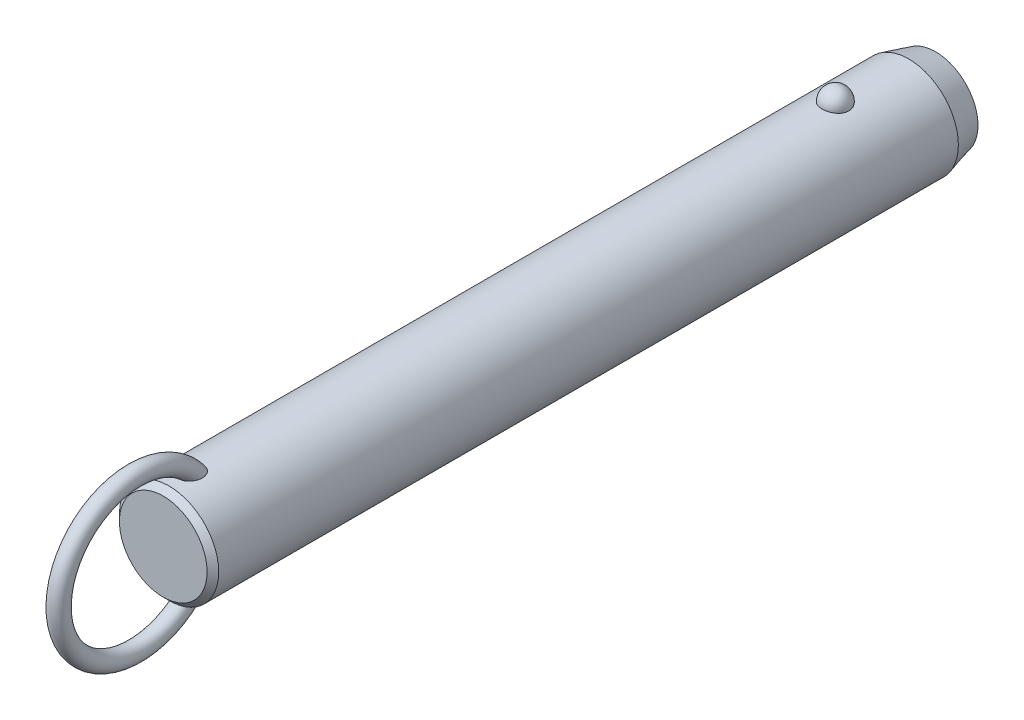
ISO-10303-21;
HEADER;
FILE_DESCRIPTION(('STEP AP214'),'2;1');
FILE_NAME('part.step','',(''),(''),'','','');
FILE_SCHEMA(('AUTOMOTIVE_DESIGN { 1 0 10303 214 1 1 1 1 }'));
ENDSEC;
DATA;
#1=APPLICATION_CONTEXT('core data for automotive mechanical design processes');
#2=APPLICATION_PROTOCOL_DEFINITION('international standard','automotive_design',2000,#1);
#3=PRODUCT_CONTEXT('',#1,'mechanical');
#4=PRODUCT('Part','Part','',(#3));
#5=PRODUCT_RELATED_PRODUCT_CATEGORY('part','',(#4));
#6=PRODUCT_DEFINITION_FORMATION('','',#4);
#7=PRODUCT_DEFINITION_CONTEXT('part definition',#1,'design');
#8=PRODUCT_DEFINITION('design','',#6,#7);
#9=PRODUCT_DEFINITION_SHAPE('','',#8);
#10=(LENGTH_UNIT() NAMED_UNIT(*) SI_UNIT(.MILLI.,.METRE.));
#11=(NAMED_UNIT(*) PLANE_ANGLE_UNIT() SI_UNIT($,.RADIAN.));
#12=(NAMED_UNIT(*) SI_UNIT($,.STERADIAN.) SOLID_ANGLE_UNIT());
#13=UNCERTAINTY_MEASURE_WITH_UNIT(LENGTH_MEASURE(1.E-05),#10,'distance_accuracy_value','');
#14=(GEOMETRIC_REPRESENTATION_CONTEXT(3) GLOBAL_UNCERTAINTY_ASSIGNED_CONTEXT((#13)) GLOBAL_UNIT_ASSIGNED_CONTEXT((#10,
#11,#12)) REPRESENTATION_CONTEXT('',''));
#15=CARTESIAN_POINT('',(0.,0.,0.));
#16=DIRECTION('',(0.,0.,1.));
#17=DIRECTION('',(1.,0.,0.));
#18=AXIS2_PLACEMENT_3D('',#15,#16,#17);
#19=CARTESIAN_POINT('',(0.,0.,134.6));
#20=DIRECTION('',(0.,0.,-1.));
#21=DIRECTION('',(-1.,0.,0.));
#22=AXIS2_PLACEMENT_3D('',#19,#20,#21);
#23=CYLINDRICAL_SURFACE('',#22,11.1);
#24=CARTESIAN_POINT('',(2.9724815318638,10.6945945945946,-3.));
#25=CARTESIAN_POINT('',(2.97247830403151,10.6945972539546,-2.83225059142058));
#26=CARTESIAN_POINT('',(2.95876598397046,10.6984356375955,-2.66445972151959));
#27=CARTESIAN_POINT('',(2.90424529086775,10.7133624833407,-2.33362381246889));
#28=CARTESIAN_POINT('',(2.8634252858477,10.7244540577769,-2.1705808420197));
#29=CARTESIAN_POINT('',(2.75573657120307,10.7526272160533,-1.85396767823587));
#30=CARTESIAN_POINT('',(2.68887937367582,10.7697061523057,-1.70039333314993));
#31=CARTESIAN_POINT('',(2.53079696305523,10.8079438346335,-1.40691598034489));
#32=CARTESIAN_POINT('',(2.43957264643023,10.8291024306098,-1.2670124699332));
#33=CARTESIAN_POINT('',(2.23458150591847,10.8732541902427,-1.00409565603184));
#34=CARTESIAN_POINT('',(2.12071295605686,10.8962553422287,-0.881162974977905));
#35=CARTESIAN_POINT('',(1.87365402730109,10.9414421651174,-0.656352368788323));
#36=CARTESIAN_POINT('',(1.74046358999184,10.9636278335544,-0.554474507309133));
#37=CARTESIAN_POINT('',(1.45872188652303,11.0046495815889,-0.374872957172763));
#38=CARTESIAN_POINT('',(1.31021276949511,11.0234944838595,-0.297085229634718));
#39=CARTESIAN_POINT('',(1.00170030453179,11.0557957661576,-0.167529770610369));
#40=CARTESIAN_POINT('',(0.841698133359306,11.0692526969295,-0.115759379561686));
#41=CARTESIAN_POINT('',(0.517607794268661,11.0890932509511,-0.0403925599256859));
#42=CARTESIAN_POINT('',(0.353633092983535,11.0955916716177,-0.0163383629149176));
#43=CARTESIAN_POINT('',(0.0238420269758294,11.1011989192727,0.0044517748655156));
#44=CARTESIAN_POINT('',(-0.141974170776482,11.1003084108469,0.00119017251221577));
#45=CARTESIAN_POINT('',(-0.468405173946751,11.0912990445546,-0.0323233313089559));
#46=CARTESIAN_POINT('',(-0.629059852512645,11.0832767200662,-0.0622147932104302));
#47=CARTESIAN_POINT('',(-0.942937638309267,11.0609962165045,-0.147645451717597));
#48=CARTESIAN_POINT('',(-1.09616062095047,11.0467379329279,-0.203185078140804));
#49=CARTESIAN_POINT('',(-1.39181061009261,11.0134071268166,-0.3387529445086));
#50=CARTESIAN_POINT('',(-1.53417383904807,10.9943086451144,-0.418913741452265));
#51=CARTESIAN_POINT('',(-1.80342160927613,10.9533667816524,-0.60144882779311));
#52=CARTESIAN_POINT('',(-1.9303046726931,10.9315231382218,-0.703825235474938));
#53=CARTESIAN_POINT('',(-2.16747598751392,10.887005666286,-0.930091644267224));
#54=CARTESIAN_POINT('',(-2.27742774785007,10.8643239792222,-1.05433291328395));
#55=CARTESIAN_POINT('',(-2.47517316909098,10.8209886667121,-1.31966633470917));
#56=CARTESIAN_POINT('',(-2.56296538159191,10.8003351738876,-1.46075958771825));
#57=CARTESIAN_POINT('',(-2.71500300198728,10.7631304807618,-1.75753646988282));
#58=CARTESIAN_POINT('',(-2.77898901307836,10.7466250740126,-1.91335887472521));
#59=CARTESIAN_POINT('',(-2.88046189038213,10.7198747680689,-2.2339152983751));
#60=CARTESIAN_POINT('',(-2.91794947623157,10.709629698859,-2.39864907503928));
#61=CARTESIAN_POINT('',(-2.96537819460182,10.6965949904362,-2.73165170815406));
#62=CARTESIAN_POINT('',(-2.97542891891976,10.693775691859,-2.89990378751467));
#63=CARTESIAN_POINT('',(-2.96804271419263,10.6958279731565,-3.235752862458));
#64=CARTESIAN_POINT('',(-2.95060646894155,10.7006993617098,-3.40334987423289));
#65=CARTESIAN_POINT('',(-2.88883358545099,10.71753912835,-3.73233906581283));
#66=CARTESIAN_POINT('',(-2.84462026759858,10.7294749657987,-3.89375610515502));
#67=CARTESIAN_POINT('',(-2.73050447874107,10.7590797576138,-4.20667949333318));
#68=CARTESIAN_POINT('',(-2.66060103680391,10.7767489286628,-4.35818546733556));
#69=CARTESIAN_POINT('',(-2.49642559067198,10.8159599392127,-4.6478542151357));
#70=CARTESIAN_POINT('',(-2.40203047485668,10.8375211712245,-4.78594458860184));
#71=CARTESIAN_POINT('',(-2.19143488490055,10.8820570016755,-5.0441038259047));
#72=CARTESIAN_POINT('',(-2.07523364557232,10.9050316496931,-5.16417205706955));
#73=CARTESIAN_POINT('',(-1.82361254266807,10.9499219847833,-5.38334833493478));
#74=CARTESIAN_POINT('',(-1.68812945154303,10.9718338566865,-5.48238464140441));
#75=CARTESIAN_POINT('',(-1.40191298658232,11.0120611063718,-5.65618873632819));
#76=CARTESIAN_POINT('',(-1.25118062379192,11.0303767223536,-5.73095813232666));
#77=CARTESIAN_POINT('',(-0.940570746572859,11.0611653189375,-5.85334725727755));
#78=CARTESIAN_POINT('',(-0.780821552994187,11.0737044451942,-5.90127578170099));
#79=CARTESIAN_POINT('',(-0.455204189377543,11.0918598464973,-5.96992976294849));
#80=CARTESIAN_POINT('',(-0.289336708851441,11.0974768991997,-5.99065827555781));
#81=CARTESIAN_POINT('',(0.0406846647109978,11.1011307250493,-6.00418773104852));
#82=CARTESIAN_POINT('',(0.204817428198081,11.099299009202,-5.99747318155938));
#83=CARTESIAN_POINT('',(0.5295530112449,11.088551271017,-5.9574031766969));
#84=CARTESIAN_POINT('',(0.69015594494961,11.0796354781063,-5.92404858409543));
#85=CARTESIAN_POINT('',(1.0027760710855,11.0557204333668,-5.83180084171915));
#86=CARTESIAN_POINT('',(1.15482001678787,11.0407414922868,-5.77299291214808));
#87=CARTESIAN_POINT('',(1.44678373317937,11.0062913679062,-5.63147366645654));
#88=CARTESIAN_POINT('',(1.58670279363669,10.9868199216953,-5.54876095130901));
#89=CARTESIAN_POINT('',(1.8527023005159,10.9451315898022,-5.36027644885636));
#90=CARTESIAN_POINT('',(1.97855158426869,10.9228788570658,-5.25418644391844));
#91=CARTESIAN_POINT('',(2.21080872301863,10.8782509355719,-5.02251354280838));
#92=CARTESIAN_POINT('',(2.31721312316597,10.8558757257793,-4.89692718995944));
#93=CARTESIAN_POINT('',(2.5094551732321,10.8130715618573,-4.62745408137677));
#94=CARTESIAN_POINT('',(2.59493284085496,10.7926798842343,-4.48330448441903));
#95=CARTESIAN_POINT('',(2.740862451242,10.7565495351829,-4.18236358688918));
#96=CARTESIAN_POINT('',(2.80132490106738,10.7408089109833,-4.02557762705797));
#97=CARTESIAN_POINT('',(2.88959070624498,10.7173718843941,-3.72475308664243));
#98=CARTESIAN_POINT('',(2.92062102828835,10.7088950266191,-3.58171216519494));
#99=CARTESIAN_POINT('',(2.96206765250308,10.6975052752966,-3.29245795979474));
#100=CARTESIAN_POINT('',(2.97248434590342,10.6945922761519,-3.14624473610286));
#101=CARTESIAN_POINT('',(2.9724815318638,10.6945945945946,-3.));
#102=B_SPLINE_CURVE_WITH_KNOTS('',3,(#24,#25,#26,#27,#28,#29,#30,#31,#32,#33,#34,#35,#36,#37,
#38,#39,#40,#41,#42,#43,#44,#45,#46,#47,#48,#49,#50,#51,#52,#53,#54,#55,#56,#57,#58,#59,#60,#61,
#62,#63,#64,#65,#66,#67,#68,#69,#70,#71,#72,#73,#74,#75,#76,#77,#78,#79,#80,#81,#82,#83,#84,#85,
#86,#87,#88,#89,#90,#91,#92,#93,#94,#95,#96,#97,#98,#99,#100,#101),.UNSPECIFIED.,.T.,.F.,(4,2,2,
2,2,2,2,2,2,2,2,2,2,2,2,2,2,2,2,2,2,2,2,2,2,2,2,2,2,2,2,2,2,2,2,2,2,2,4),(0.,0.502722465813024,
1.00566079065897,1.5083769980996,2.01107471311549,2.51608392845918,3.02109467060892,
3.52475118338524,4.02835620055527,4.523518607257,5.0186364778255,5.50715297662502,
5.9956776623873,6.48688002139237,6.97812923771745,7.47814366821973,7.9781907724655,
8.48353712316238,8.9888697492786,9.49218093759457,9.99547960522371,10.4964777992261,
10.997494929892,11.5010810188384,12.0046847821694,12.5099796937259,13.0152411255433,
13.5145635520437,14.0138298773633,14.5043200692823,14.9947943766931,15.4836390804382,
15.9725123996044,16.4685040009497,16.9645836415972,17.4686765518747,17.972557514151,
18.410841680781,18.849117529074),.UNSPECIFIED.);
#103=CARTESIAN_POINT('',(2.9724815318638,10.6945945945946,-3.));
#104=VERTEX_POINT('',#103);
#105=EDGE_CURVE('E41',#104,#104,#102,.T.);
#106=ORIENTED_EDGE('',*,*,#105,.T.);
#107=EDGE_LOOP('',(#106));
#108=FACE_BOUND('',#107,.T.);
#109=CARTESIAN_POINT('',(0.,0.,146.));
#110=DIRECTION('',(0.,0.,1.));
#111=DIRECTION('',(1.,0.,0.));
#112=AXIS2_PLACEMENT_3D('',#109,#110,#111);
#113=CIRCLE('',#112,11.1);
#114=CARTESIAN_POINT('',(11.1,0.,146.));
#115=VERTEX_POINT('',#114);
#116=EDGE_CURVE('E10',#115,#115,#113,.F.);
#117=ORIENTED_EDGE('',*,*,#116,.T.);
#118=EDGE_LOOP('',(#117));
#119=FACE_BOUND('',#118,.T.);
#120=CARTESIAN_POINT('',(-0.564520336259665,-11.0856356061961,138.257815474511));
#121=CARTESIAN_POINT('',(-0.667202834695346,-11.0804062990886,138.291283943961));
#122=CARTESIAN_POINT('',(-0.766875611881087,-11.0738877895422,138.333835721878));
#123=CARTESIAN_POINT('',(-0.95728412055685,-11.0590576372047,138.435419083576));
#124=CARTESIAN_POINT('',(-1.04801616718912,-11.0507452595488,138.49445742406));
#125=CARTESIAN_POINT('',(-1.21800952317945,-11.0333016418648,138.626529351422));
#126=CARTESIAN_POINT('',(-1.2973080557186,-11.0241732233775,138.699515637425));
#127=CARTESIAN_POINT('',(-1.44337665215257,-11.0060026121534,138.857037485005));
#128=CARTESIAN_POINT('',(-1.51014622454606,-10.9969604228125,138.941573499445));
#129=CARTESIAN_POINT('',(-1.63454620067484,-10.9791841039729,139.125521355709));
#130=CARTESIAN_POINT('',(-1.69127003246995,-10.9705107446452,139.225549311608));
#131=CARTESIAN_POINT('',(-1.7898078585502,-10.9548648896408,139.432790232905));
#132=CARTESIAN_POINT('',(-1.83161214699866,-10.9478935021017,139.540007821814));
#133=CARTESIAN_POINT('',(-1.91557028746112,-10.9335803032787,139.805408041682));
#134=CARTESIAN_POINT('',(-1.95040620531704,-10.9273269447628,139.965980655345));
#135=CARTESIAN_POINT('',(-1.99388326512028,-10.9194709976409,140.290697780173));
#136=CARTESIAN_POINT('',(-2.00248051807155,-10.9178762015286,140.454847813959));
#137=CARTESIAN_POINT('',(-1.99551615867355,-10.9191578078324,140.824650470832));
#138=CARTESIAN_POINT('',(-1.9732206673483,-10.9232807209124,141.030191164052));
#139=CARTESIAN_POINT('',(-1.9152976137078,-10.9335244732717,141.333595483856));
#140=CARTESIAN_POINT('',(-1.89184575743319,-10.9376266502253,141.434088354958));
#141=CARTESIAN_POINT('',(-1.83700674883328,-10.9469720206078,141.632855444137));
#142=CARTESIAN_POINT('',(-1.80562070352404,-10.9522150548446,141.731129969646));
#143=CARTESIAN_POINT('',(-1.73463055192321,-10.9636837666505,141.925914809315));
#144=CARTESIAN_POINT('',(-1.69493416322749,-10.9699202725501,142.022390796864));
#145=CARTESIAN_POINT('',(-1.60745141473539,-10.9830806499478,142.211626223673));
#146=CARTESIAN_POINT('',(-1.55966150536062,-10.9900048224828,142.304384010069));
#147=CARTESIAN_POINT('',(-1.45591812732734,-11.0042280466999,142.484690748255));
#148=CARTESIAN_POINT('',(-1.40000013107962,-11.0115253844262,142.572260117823));
#149=CARTESIAN_POINT('',(-1.27937470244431,-11.0261911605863,142.741029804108));
#150=CARTESIAN_POINT('',(-1.21467835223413,-11.0335594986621,142.82223795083));
#151=CARTESIAN_POINT('',(-1.08218150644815,-11.0473027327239,142.969001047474));
#152=CARTESIAN_POINT('',(-1.01522633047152,-11.0537063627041,143.035309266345));
#153=CARTESIAN_POINT('',(-0.872952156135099,-11.065850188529,143.158378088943));
#154=CARTESIAN_POINT('',(-0.797642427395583,-11.0715911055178,143.215149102));
#155=CARTESIAN_POINT('',(-0.651396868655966,-11.081071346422,143.307515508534));
#156=CARTESIAN_POINT('',(-0.581712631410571,-11.0849841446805,143.345049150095));
#157=CARTESIAN_POINT('',(-0.437066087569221,-11.0916271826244,143.408259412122));
#158=CARTESIAN_POINT('',(-0.362109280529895,-11.0943586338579,143.433948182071));
#159=CARTESIAN_POINT('',(-0.207828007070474,-11.0983242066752,143.471117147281));
#160=CARTESIAN_POINT('',(-0.12846771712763,-11.0995432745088,143.482454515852));
#161=CARTESIAN_POINT('',(0.0309101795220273,-11.1002423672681,143.488965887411));
#162=CARTESIAN_POINT('',(0.110927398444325,-11.0997233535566,143.484148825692));
#163=CARTESIAN_POINT('',(0.25640659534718,-11.097240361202,143.460959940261));
#164=CARTESIAN_POINT('',(0.322235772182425,-11.0955074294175,143.444754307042));
#165=CARTESIAN_POINT('',(0.450635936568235,-11.0910350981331,143.402600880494));
#166=CARTESIAN_POINT('',(0.513205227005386,-11.0882951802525,143.376648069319));
#167=CARTESIAN_POINT('',(0.662626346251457,-11.0805620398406,143.302607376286));
#168=CARTESIAN_POINT('',(0.747127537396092,-11.0751144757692,143.249845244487));
#169=CARTESIAN_POINT('',(0.906756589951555,-11.0631932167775,143.131720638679));
#170=CARTESIAN_POINT('',(0.981859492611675,-11.0567168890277,143.066325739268));
#171=CARTESIAN_POINT('',(1.10712207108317,-11.0447856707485,142.94226337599));
#172=CARTESIAN_POINT('',(1.15909566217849,-11.0394280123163,142.885383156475));
#173=CARTESIAN_POINT('',(1.2579192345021,-11.0286040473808,142.767327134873));
#174=CARTESIAN_POINT('',(1.30476642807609,-11.0231376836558,142.706149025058));
#175=CARTESIAN_POINT('',(1.43818612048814,-11.0068027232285,142.517305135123));
#176=CARTESIAN_POINT('',(1.51751767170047,-10.9960104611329,142.384453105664));
#177=CARTESIAN_POINT('',(1.63597546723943,-10.9788847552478,142.153137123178));
#178=CARTESIAN_POINT('',(1.67988876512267,-10.9722190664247,142.057053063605));
#179=CARTESIAN_POINT('',(1.75953241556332,-10.9597298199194,141.861431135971));
#180=CARTESIAN_POINT('',(1.7952596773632,-10.9539065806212,141.761891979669));
#181=CARTESIAN_POINT('',(1.85844731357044,-10.9433632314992,141.56021118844));
#182=CARTESIAN_POINT('',(1.88591073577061,-10.9386427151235,141.45807052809));
#183=CARTESIAN_POINT('',(1.93234324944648,-10.9305350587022,141.251819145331));
#184=CARTESIAN_POINT('',(1.95131065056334,-10.9271481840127,141.147708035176));
#185=CARTESIAN_POINT('',(1.9904020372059,-10.9201183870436,140.865458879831));
#186=CARTESIAN_POINT('',(2.00221217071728,-10.9179256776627,140.686037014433));
#187=CARTESIAN_POINT('',(1.99711676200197,-10.9188636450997,140.327713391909));
#188=CARTESIAN_POINT('',(1.98026150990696,-10.9219849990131,140.148811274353));
#189=CARTESIAN_POINT('',(1.92151657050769,-10.9324473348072,139.83645144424));
#190=CARTESIAN_POINT('',(1.88605081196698,-10.9386915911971,139.701759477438));
#191=CARTESIAN_POINT('',(1.79393020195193,-10.9541780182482,139.439966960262));
#192=CARTESIAN_POINT('',(1.73729868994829,-10.9634168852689,139.312858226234));
#193=CARTESIAN_POINT('',(1.61237037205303,-10.9824218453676,139.089418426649));
#194=CARTESIAN_POINT('',(1.54715374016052,-10.9918945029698,138.991345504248));
#195=CARTESIAN_POINT('',(1.40127026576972,-11.0114415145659,138.807434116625));
#196=CARTESIAN_POINT('',(1.32060742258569,-11.0215157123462,138.721592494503));
#197=CARTESIAN_POINT('',(1.1447478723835,-11.041168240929,138.565163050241));
#198=CARTESIAN_POINT('',(1.04947805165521,-11.0507437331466,138.494656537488));
#199=CARTESIAN_POINT('',(0.847278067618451,-11.0680789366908,138.372640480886));
#200=CARTESIAN_POINT('',(0.74035174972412,-11.0758392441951,138.321124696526));
#201=CARTESIAN_POINT('',(0.529289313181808,-11.0878275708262,138.243485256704));
#202=CARTESIAN_POINT('',(0.425895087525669,-11.0923259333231,138.215377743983));
#203=CARTESIAN_POINT('',(0.215723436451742,-11.0984001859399,138.177703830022));
#204=CARTESIAN_POINT('',(0.108947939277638,-11.0999777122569,138.168127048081));
#205=CARTESIAN_POINT('',(-0.0938962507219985,-11.1000196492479,138.167877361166));
#206=CARTESIAN_POINT('',(-0.189967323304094,-11.0987797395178,138.175408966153));
#207=CARTESIAN_POINT('',(-0.379657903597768,-11.0939111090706,138.205507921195));
#208=CARTESIAN_POINT('',(-0.47327735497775,-11.0902823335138,138.228075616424));
#209=CARTESIAN_POINT('',(-0.564520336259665,-11.0856356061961,138.257815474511));
#210=B_SPLINE_CURVE_WITH_KNOTS('',3,(#120,#121,#122,#123,#124,#125,#126,#127,#128,#129,#130,
#131,#132,#133,#134,#135,#136,#137,#138,#139,#140,#141,#142,#143,#144,#145,#146,#147,#148,#149,
#150,#151,#152,#153,#154,#155,#156,#157,#158,#159,#160,#161,#162,#163,#164,#165,#166,#167,#168,
#169,#170,#171,#172,#173,#174,#175,#176,#177,#178,#179,#180,#181,#182,#183,#184,#185,#186,#187,
#188,#189,#190,#191,#192,#193,#194,#195,#196,#197,#198,#199,#200,#201,#202,#203,#204,#205,#206,
#207,#208,#209),.UNSPECIFIED.,.T.,.F.,(4,2,2,2,2,2,2,2,2,2,2,2,2,2,2,2,2,2,2,2,2,2,2,2,2,2,2,2,
2,2,2,2,2,2,2,2,2,2,2,2,2,2,2,2,4),(0.,0.323999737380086,0.64813245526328,0.971184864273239,
1.29424994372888,1.63886237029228,1.98369857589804,2.47426059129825,2.96564271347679,
3.58257396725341,3.89215258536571,4.20168803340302,4.51486273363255,4.82817514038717,
5.14015911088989,5.45175282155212,5.73442856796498,6.01679375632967,6.2536458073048,
6.49025437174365,6.72919963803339,6.96801276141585,7.17061258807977,7.37331685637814,
7.67094989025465,7.96935728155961,8.20075067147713,8.43226927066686,8.89581623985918,
9.21306533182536,9.53043400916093,9.84768549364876,10.1650000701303,10.7022930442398,
11.2386443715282,11.655339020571,12.071575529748,12.4245637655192,12.7774607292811,
13.1321855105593,13.4867936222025,13.8068771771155,14.1267813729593,14.4146787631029,
14.7025827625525),.UNSPECIFIED.);
#211=CARTESIAN_POINT('',(-0.564520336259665,-11.0856356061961,138.257815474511));
#212=VERTEX_POINT('',#211);
#213=EDGE_CURVE('E60',#212,#212,#210,.T.);
#214=ORIENTED_EDGE('',*,*,#213,.T.);
#215=EDGE_LOOP('',(#214));
#216=FACE_BOUND('',#215,.T.);
#217=CARTESIAN_POINT('',(-0.564520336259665,11.0856356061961,138.257815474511));
#218=CARTESIAN_POINT('',(-0.468542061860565,11.0905203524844,138.226545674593));
#219=CARTESIAN_POINT('',(-0.369793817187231,11.0942886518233,138.203157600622));
#220=CARTESIAN_POINT('',(-0.169555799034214,11.0991586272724,138.173085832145));
#221=CARTESIAN_POINT('',(-0.0680604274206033,11.1002543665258,138.16643932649));
#222=CARTESIAN_POINT('',(0.134549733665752,11.099646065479,138.170157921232));
#223=CARTESIAN_POINT('',(0.235664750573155,11.0979441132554,138.18051033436));
#224=CARTESIAN_POINT('',(0.434632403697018,11.0919342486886,138.217831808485));
#225=CARTESIAN_POINT('',(0.532486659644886,11.0876276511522,138.244792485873));
#226=CARTESIAN_POINT('',(0.722445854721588,11.0768742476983,138.3144096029));
#227=CARTESIAN_POINT('',(0.814543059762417,11.0704246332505,138.357086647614));
#228=CARTESIAN_POINT('',(0.990565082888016,11.0560659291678,138.456648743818));
#229=CARTESIAN_POINT('',(1.07448844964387,11.048156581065,138.513536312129));
#230=CARTESIAN_POINT('',(1.23562672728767,11.0313221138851,138.642210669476));
#231=CARTESIAN_POINT('',(1.3124268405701,11.0223686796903,138.714511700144));
#232=CARTESIAN_POINT('',(1.45398030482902,11.0045918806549,138.870042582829));
#233=CARTESIAN_POINT('',(1.51873073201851,10.9957685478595,138.953275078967));
#234=CARTESIAN_POINT('',(1.64107232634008,10.9782087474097,139.136384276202));
#235=CARTESIAN_POINT('',(1.6974317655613,10.9695572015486,139.237089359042));
#236=CARTESIAN_POINT('',(1.79515063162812,10.9539887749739,139.445626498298));
#237=CARTESIAN_POINT('',(1.83649966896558,10.9470730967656,139.55346343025));
#238=CARTESIAN_POINT('',(1.91931148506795,10.9329211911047,139.820399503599));
#239=CARTESIAN_POINT('',(1.95340104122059,10.9267904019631,139.981861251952));
#240=CARTESIAN_POINT('',(1.99526195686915,10.9192174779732,140.30821631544));
#241=CARTESIAN_POINT('',(2.00298989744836,10.9177830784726,140.47311484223));
#242=CARTESIAN_POINT('',(1.99396251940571,10.9194420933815,140.844100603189));
#243=CARTESIAN_POINT('',(1.97050829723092,10.923774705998,141.05003871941));
#244=CARTESIAN_POINT('',(1.91079643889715,10.9343131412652,141.353901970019));
#245=CARTESIAN_POINT('',(1.88673702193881,10.9385106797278,141.454529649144));
#246=CARTESIAN_POINT('',(1.8306550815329,10.9480376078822,141.653510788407));
#247=CARTESIAN_POINT('',(1.79863369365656,10.9533668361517,141.751864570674));
#248=CARTESIAN_POINT('',(1.72633365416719,10.9649954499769,141.946720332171));
#249=CARTESIAN_POINT('',(1.68596409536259,10.9713053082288,142.04318790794));
#250=CARTESIAN_POINT('',(1.59707998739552,10.9845964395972,142.232323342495));
#251=CARTESIAN_POINT('',(1.54856169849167,10.9915780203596,142.324989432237));
#252=CARTESIAN_POINT('',(1.44330168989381,11.0058935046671,142.504975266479));
#253=CARTESIAN_POINT('',(1.3865974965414,11.0132257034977,142.592316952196));
#254=CARTESIAN_POINT('',(1.26431158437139,11.0279330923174,142.760456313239));
#255=CARTESIAN_POINT('',(1.19874160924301,11.0353082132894,142.841262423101));
#256=CARTESIAN_POINT('',(1.06542088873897,11.048931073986,142.985985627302));
#257=CARTESIAN_POINT('',(0.998640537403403,11.0552153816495,143.050784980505));
#258=CARTESIAN_POINT('',(0.856896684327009,11.0671032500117,143.170846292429));
#259=CARTESIAN_POINT('',(0.781942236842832,11.0727075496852,143.226118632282));
#260=CARTESIAN_POINT('',(0.636276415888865,11.081949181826,143.315972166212));
#261=CARTESIAN_POINT('',(0.566755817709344,11.0857572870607,143.352441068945));
#262=CARTESIAN_POINT('',(0.422602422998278,11.0921860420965,143.413533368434));
#263=CARTESIAN_POINT('',(0.347974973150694,11.0948079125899,143.438168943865));
#264=CARTESIAN_POINT('',(0.194593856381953,11.0985608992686,143.473323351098));
#265=CARTESIAN_POINT('',(0.115807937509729,11.0996777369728,143.483706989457));
#266=CARTESIAN_POINT('',(-0.0422499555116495,11.1002003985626,143.488574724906));
#267=CARTESIAN_POINT('',(-0.121521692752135,11.09960699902,143.483066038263));
#268=CARTESIAN_POINT('',(-0.266046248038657,11.0970123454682,143.458827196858));
#269=CARTESIAN_POINT('',(-0.331661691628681,11.0952283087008,143.442135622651));
#270=CARTESIAN_POINT('',(-0.459588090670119,11.0906663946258,143.399111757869));
#271=CARTESIAN_POINT('',(-0.52189737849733,11.0878880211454,143.372774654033));
#272=CARTESIAN_POINT('',(-0.671446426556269,11.0800342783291,143.297513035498));
#273=CARTESIAN_POINT('',(-0.756250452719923,11.0744969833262,143.243818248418));
#274=CARTESIAN_POINT('',(-0.916349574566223,11.0624045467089,143.123802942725));
#275=CARTESIAN_POINT('',(-0.991618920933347,11.0558467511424,143.057449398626));
#276=CARTESIAN_POINT('',(-1.11713140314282,11.0437783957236,142.931633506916));
#277=CARTESIAN_POINT('',(-1.1692053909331,11.0383619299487,142.873952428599));
#278=CARTESIAN_POINT('',(-1.26817476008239,11.02743010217,142.754280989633));
#279=CARTESIAN_POINT('',(-1.31506731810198,11.0219146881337,142.692288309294));
#280=CARTESIAN_POINT('',(-1.40399813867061,11.0109399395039,142.564784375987));
#281=CARTESIAN_POINT('',(-1.44602864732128,11.0054807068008,142.499267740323));
#282=CARTESIAN_POINT('',(-1.52538779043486,10.9947621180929,142.365422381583));
#283=CARTESIAN_POINT('',(-1.56271516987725,10.9895028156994,142.297092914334));
#284=CARTESIAN_POINT('',(-1.64537943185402,10.9774790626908,142.133210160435));
#285=CARTESIAN_POINT('',(-1.68879497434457,10.9708503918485,142.0366735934));
#286=CARTESIAN_POINT('',(-1.76740738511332,10.9584602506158,141.840236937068));
#287=CARTESIAN_POINT('',(-1.80260120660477,10.95269910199,141.74033561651));
#288=CARTESIAN_POINT('',(-1.86468657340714,10.9423003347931,141.537966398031));
#289=CARTESIAN_POINT('',(-1.8915816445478,10.9376622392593,141.435499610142));
#290=CARTESIAN_POINT('',(-1.93682458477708,10.9297405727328,141.228642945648));
#291=CARTESIAN_POINT('',(-1.95517082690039,10.9264572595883,141.124252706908));
#292=CARTESIAN_POINT('',(-1.99232562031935,10.9197647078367,140.84262876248));
#293=CARTESIAN_POINT('',(-2.00294603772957,10.9177914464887,140.664185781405));
#294=CARTESIAN_POINT('',(-1.99566675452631,10.9191290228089,140.307996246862));
#295=CARTESIAN_POINT('',(-1.97781651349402,10.9224306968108,140.13024902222));
#296=CARTESIAN_POINT('',(-1.91747214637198,10.9331592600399,139.819792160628));
#297=CARTESIAN_POINT('',(-1.88131022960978,10.9395108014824,139.685825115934));
#298=CARTESIAN_POINT('',(-1.78790380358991,10.9551659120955,139.42559757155));
#299=CARTESIAN_POINT('',(-1.73068309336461,10.9644661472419,139.299328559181));
#300=CARTESIAN_POINT('',(-1.60475573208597,10.9835398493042,139.07741565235));
#301=CARTESIAN_POINT('',(-1.53908879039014,10.9930297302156,138.980026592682));
#302=CARTESIAN_POINT('',(-1.39238608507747,11.0125708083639,138.797525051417));
#303=CARTESIAN_POINT('',(-1.31135150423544,11.0226219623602,138.712411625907));
#304=CARTESIAN_POINT('',(-1.14382035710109,11.0411991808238,138.56529943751));
#305=CARTESIAN_POINT('',(-1.0585850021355,11.0497792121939,138.50186930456));
#306=CARTESIAN_POINT('',(-0.878723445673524,11.0655285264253,138.390250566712));
#307=CARTESIAN_POINT('',(-0.784123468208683,11.0727015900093,138.342020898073));
#308=CARTESIAN_POINT('',(-0.646163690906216,11.0812501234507,138.286023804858));
#309=CARTESIAN_POINT('',(-0.605595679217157,11.0835451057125,138.271197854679));
#310=CARTESIAN_POINT('',(-0.564520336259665,11.0856356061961,138.257815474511));
#311=B_SPLINE_CURVE_WITH_KNOTS('',3,(#217,#218,#219,#220,#221,#222,#223,#224,#225,#226,#227,
#228,#229,#230,#231,#232,#233,#234,#235,#236,#237,#238,#239,#240,#241,#242,#243,#244,#245,#246,
#247,#248,#249,#250,#251,#252,#253,#254,#255,#256,#257,#258,#259,#260,#261,#262,#263,#264,#265,
#266,#267,#268,#269,#270,#271,#272,#273,#274,#275,#276,#277,#278,#279,#280,#281,#282,#283,#284,
#285,#286,#287,#288,#289,#290,#291,#292,#293,#294,#295,#296,#297,#298,#299,#300,#301,#302,#303,
#304,#305,#306,#307,#308,#309,#310),.UNSPECIFIED.,.T.,.F.,(4,2,2,2,2,2,2,2,2,2,2,2,2,2,2,2,2,2,
2,2,2,2,2,2,2,2,2,2,2,2,2,2,2,2,2,2,2,2,2,2,2,2,2,2,2,2,4),(0.,0.303061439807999,
0.606795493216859,0.910302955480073,1.21365733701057,1.51741085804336,1.82121821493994,
2.13745205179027,2.45376252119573,2.79958678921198,3.14564996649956,3.63832391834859,
4.13180893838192,4.75031912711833,5.06071926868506,5.37107516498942,5.6850077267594,
5.99908475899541,6.31176519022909,6.62403542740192,6.90315673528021,7.18197194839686,
7.41687778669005,7.65154134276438,7.88841587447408,8.12518286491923,8.32752842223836,
8.52997509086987,8.82986421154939,9.13054668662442,9.36393502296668,9.59744991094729,
9.83133221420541,10.0652767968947,10.383032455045,10.7009056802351,11.0186436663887,
11.3364420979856,11.8705925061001,12.4038159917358,12.8189662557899,13.2336487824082,
13.5857049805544,13.9377340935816,14.2561354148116,14.5736690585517,14.7033687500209),.UNSPECIFIED.);
#312=CARTESIAN_POINT('',(-0.564520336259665,11.0856356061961,138.257815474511));
#313=VERTEX_POINT('',#312);
#314=EDGE_CURVE('E68',#313,#313,#311,.T.);
#315=ORIENTED_EDGE('',*,*,#314,.T.);
#316=EDGE_LOOP('',(#315));
#317=FACE_BOUND('',#316,.T.);
#318=CARTESIAN_POINT('',(0.,0.,-19.3999999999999));
#319=DIRECTION('',(0.,0.,-1.));
#320=DIRECTION('',(-1.,0.,0.));
#321=AXIS2_PLACEMENT_3D('',#318,#319,#320);
#322=CIRCLE('',#321,11.1);
#323=CARTESIAN_POINT('',(11.1,0.,-19.3999999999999));
#324=VERTEX_POINT('',#323);
#325=EDGE_CURVE('E57',#324,#324,#322,.F.);
#326=ORIENTED_EDGE('',*,*,#325,.T.);
#327=EDGE_LOOP('',(#326));
#328=FACE_BOUND('',#327,.T.);
#329=ADVANCED_FACE('F37',(#108,#119,#216,#317,#328),#23,.T.);
#330=CARTESIAN_POINT('',(0.,0.,-25.4));
#331=DIRECTION('',(0.,0.,-1.));
#332=DIRECTION('',(-1.,0.,0.));
#333=AXIS2_PLACEMENT_3D('',#330,#331,#332);
#334=PLANE('',#333);
#335=CARTESIAN_POINT('',(0.,0.,-25.4));
#336=DIRECTION('',(0.,0.,-1.));
#337=DIRECTION('',(-1.,0.,0.));
#338=AXIS2_PLACEMENT_3D('',#335,#336,#337);
#339=CIRCLE('',#338,9.49230484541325);
#340=CARTESIAN_POINT('',(9.49230484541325,0.,-25.4));
#341=VERTEX_POINT('',#340);
#342=EDGE_CURVE('E67',#341,#341,#339,.T.);
#343=ORIENTED_EDGE('',*,*,#342,.T.);
#344=EDGE_LOOP('',(#343));
#345=FACE_BOUND('',#344,.T.);
#346=ADVANCED_FACE('F86',(#345),#334,.T.);
#347=CARTESIAN_POINT('',(0.,0.,-25.4));
#348=DIRECTION('',(0.,0.,1.));
#349=DIRECTION('',(1.,0.,0.));
#350=AXIS2_PLACEMENT_3D('',#347,#348,#349);
#351=CONICAL_SURFACE('',#350,9.49230484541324,0.261799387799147);
#352=CARTESIAN_POINT('',(11.1,0.,-19.3999999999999));
#353=CARTESIAN_POINT('',(11.0832531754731,0.,-19.4624999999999));
#354=CARTESIAN_POINT('',(11.0665063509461,0.,-19.5249999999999));
#355=CARTESIAN_POINT('',(11.0330127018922,0.,-19.6499999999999));
#356=CARTESIAN_POINT('',(11.0162658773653,0.,-19.7124999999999));
#357=CARTESIAN_POINT('',(10.9827722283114,0.,-19.8374999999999));
#358=CARTESIAN_POINT('',(10.9660254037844,0.,-19.8999999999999));
#359=CARTESIAN_POINT('',(10.9325317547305,0.,-20.0249999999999));
#360=CARTESIAN_POINT('',(10.9157849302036,0.,-20.0874999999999));
#361=CARTESIAN_POINT('',(10.8822912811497,0.,-20.2124999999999));
#362=CARTESIAN_POINT('',(10.8655444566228,0.,-20.2749999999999));
#363=CARTESIAN_POINT('',(10.8320508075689,0.,-20.3999999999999));
#364=CARTESIAN_POINT('',(10.8153039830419,0.,-20.4624999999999));
#365=CARTESIAN_POINT('',(10.781810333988,0.,-20.5874999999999));
#366=CARTESIAN_POINT('',(10.7650635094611,0.,-20.6499999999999));
#367=CARTESIAN_POINT('',(10.7315698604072,0.,-20.7749999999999));
#368=CARTESIAN_POINT('',(10.7148230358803,0.,-20.8374999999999));
#369=CARTESIAN_POINT('',(10.6813293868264,0.,-20.9624999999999));
#370=CARTESIAN_POINT('',(10.6645825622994,0.,-21.0249999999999));
#371=CARTESIAN_POINT('',(10.6310889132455,0.,-21.1499999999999));
#372=CARTESIAN_POINT('',(10.6143420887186,0.,-21.2124999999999));
#373=CARTESIAN_POINT('',(10.5808484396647,0.,-21.3374999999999));
#374=CARTESIAN_POINT('',(10.5641016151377,0.,-21.3999999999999));
#375=CARTESIAN_POINT('',(10.5306079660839,0.,-21.5249999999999));
#376=CARTESIAN_POINT('',(10.5138611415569,0.,-21.5874999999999));
#377=CARTESIAN_POINT('',(10.480367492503,0.,-21.7124999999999));
#378=CARTESIAN_POINT('',(10.4636206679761,0.,-21.7749999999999));
#379=CARTESIAN_POINT('',(10.4301270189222,0.,-21.8999999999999));
#380=CARTESIAN_POINT('',(10.4133801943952,0.,-21.9624999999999));
#381=CARTESIAN_POINT('',(10.3798865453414,0.,-22.0874999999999));
#382=CARTESIAN_POINT('',(10.3631397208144,0.,-22.1499999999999));
#383=CARTESIAN_POINT('',(10.3296460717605,0.,-22.2749999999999));
#384=CARTESIAN_POINT('',(10.3128992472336,0.,-22.3374999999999));
#385=CARTESIAN_POINT('',(10.2794055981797,0.,-22.4624999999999));
#386=CARTESIAN_POINT('',(10.2626587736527,0.,-22.5249999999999));
#387=CARTESIAN_POINT('',(10.2291651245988,0.,-22.6499999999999));
#388=CARTESIAN_POINT('',(10.2124183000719,0.,-22.7124999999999));
#389=CARTESIAN_POINT('',(10.178924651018,0.,-22.8374999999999));
#390=CARTESIAN_POINT('',(10.1621778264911,0.,-22.8999999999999));
#391=CARTESIAN_POINT('',(10.1286841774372,0.,-23.0249999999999));
#392=CARTESIAN_POINT('',(10.1119373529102,0.,-23.0874999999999));
#393=CARTESIAN_POINT('',(10.0784437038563,0.,-23.2124999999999));
#394=CARTESIAN_POINT('',(10.0616968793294,0.,-23.2749999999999));
#395=CARTESIAN_POINT('',(10.0282032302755,0.,-23.4));
#396=CARTESIAN_POINT('',(10.0114564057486,0.,-23.4625));
#397=CARTESIAN_POINT('',(9.97796275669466,0.,-23.5875));
#398=CARTESIAN_POINT('',(9.96121593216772,0.,-23.65));
#399=CARTESIAN_POINT('',(9.92772228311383,0.,-23.775));
#400=CARTESIAN_POINT('',(9.91097545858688,0.,-23.8375));
#401=CARTESIAN_POINT('',(9.87748180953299,0.,-23.9625));
#402=CARTESIAN_POINT('',(9.86073498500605,0.,-24.025));
#403=CARTESIAN_POINT('',(9.82724133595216,0.,-24.15));
#404=CARTESIAN_POINT('',(9.81049451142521,0.,-24.2125));
#405=CARTESIAN_POINT('',(9.77700086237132,0.,-24.3375));
#406=CARTESIAN_POINT('',(9.76025403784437,0.,-24.4));
#407=CARTESIAN_POINT('',(9.72676038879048,0.,-24.525));
#408=CARTESIAN_POINT('',(9.71001356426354,0.,-24.5875));
#409=CARTESIAN_POINT('',(9.67651991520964,0.,-24.7125));
#410=CARTESIAN_POINT('',(9.6597730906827,0.,-24.775));
#411=CARTESIAN_POINT('',(9.62627944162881,0.,-24.9));
#412=CARTESIAN_POINT('',(9.60953261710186,0.,-24.9625));
#413=CARTESIAN_POINT('',(9.57603896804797,0.,-25.0875));
#414=CARTESIAN_POINT('',(9.55929214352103,0.,-25.15));
#415=CARTESIAN_POINT('',(9.52579849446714,0.,-25.275));
#416=CARTESIAN_POINT('',(9.50905166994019,0.,-25.3375));
#417=CARTESIAN_POINT('',(9.49230484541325,0.,-25.4));
#418=B_SPLINE_CURVE_WITH_KNOTS('',3,(#352,#353,#354,#355,#356,#357,#358,#359,#360,#361,#362,
#363,#364,#365,#366,#367,#368,#369,#370,#371,#372,#373,#374,#375,#376,#377,#378,#379,#380,#381,
#382,#383,#384,#385,#386,#387,#388,#389,#390,#391,#392,#393,#394,#395,#396,#397,#398,#399,#400,
#401,#402,#403,#404,#405,#406,#407,#408,#409,#410,#411,#412,#413,#414,#415,#416,#417),
.UNSPECIFIED.,.F.,.F.,(4,2,2,2,2,2,2,2,2,2,2,2,2,2,2,2,2,2,2,2,2,2,2,2,2,2,2,2,2,2,2,2,4),(0.,
0.194114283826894,0.388228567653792,0.582342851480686,0.77645713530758,0.970571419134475,
1.16468570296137,1.35879998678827,1.55291427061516,1.74702855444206,1.94114283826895,
2.13525712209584,2.32937140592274,2.52348568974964,2.71759997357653,2.91171425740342,
3.10582854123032,3.29994282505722,3.49405710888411,3.68817139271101,3.8822856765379,
4.07639996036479,4.27051424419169,4.46462852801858,4.65874281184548,4.85285709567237,
5.04697137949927,5.24108566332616,5.43519994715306,5.62931423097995,5.82342851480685,
6.01754279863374,6.21165708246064),.UNSPECIFIED.);
#419=EDGE_CURVE('BSEAM84',#324,#341,#418,.T.);
#420=ORIENTED_EDGE('',*,*,#325,.F.);
#421=ORIENTED_EDGE('',*,*,#342,.F.);
#422=ORIENTED_EDGE('',*,*,#419,.T.);
#423=ORIENTED_EDGE('',*,*,#419,.F.);
#424=EDGE_LOOP('',(#420,#422,#421,#423));
#425=FACE_BOUND('',#424,.T.);
#426=ADVANCED_FACE('F84',(#425),#351,.T.);
#427=CARTESIAN_POINT('',(0.,0.,147.3));
#428=DIRECTION('',(0.,0.,1.));
#429=DIRECTION('',(1.,0.,0.));
#430=AXIS2_PLACEMENT_3D('',#427,#428,#429);
#431=PLANE('',#430);
#432=CARTESIAN_POINT('',(0.,0.,147.3));
#433=DIRECTION('',(0.,0.,1.));
#434=DIRECTION('',(1.,0.,0.));
#435=AXIS2_PLACEMENT_3D('',#432,#433,#434);
#436=CIRCLE('',#435,9.79999999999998);
#437=CARTESIAN_POINT('',(9.79999999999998,0.,147.3));
#438=VERTEX_POINT('',#437);
#439=EDGE_CURVE('E50',#438,#438,#436,.T.);
#440=ORIENTED_EDGE('',*,*,#439,.T.);
#441=EDGE_LOOP('',(#440));
#442=FACE_BOUND('',#441,.T.);
#443=ADVANCED_FACE('F78',(#442),#431,.T.);
#444=CARTESIAN_POINT('',(0.,0.,153.65));
#445=DIRECTION('',(1.,0.,0.));
#446=DIRECTION('',(0.,0.,-1.));
#447=AXIS2_PLACEMENT_3D('',#444,#445,#446);
#448=TOROIDAL_SURFACE('',#447,17.05,2.);
#449=ORIENTED_EDGE('',*,*,#314,.F.);
#450=EDGE_LOOP('',(#449));
#451=FACE_BOUND('',#450,.T.);
#452=ORIENTED_EDGE('',*,*,#213,.F.);
#453=EDGE_LOOP('',(#452));
#454=FACE_BOUND('',#453,.T.);
#455=ADVANCED_FACE('F74',(#451,#454),#448,.T.);
#456=CARTESIAN_POINT('',(0.,0.,147.3));
#457=DIRECTION('',(0.,0.,-1.));
#458=DIRECTION('',(-1.,0.,0.));
#459=AXIS2_PLACEMENT_3D('',#456,#457,#458);
#460=CONICAL_SURFACE('',#459,9.79999999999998,0.785398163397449);
#461=ORIENTED_EDGE('',*,*,#116,.F.);
#462=EDGE_LOOP('',(#461));
#463=FACE_BOUND('',#462,.T.);
#464=ORIENTED_EDGE('',*,*,#439,.F.);
#465=EDGE_LOOP('',(#464));
#466=FACE_BOUND('',#465,.T.);
#467=ADVANCED_FACE('F39',(#463,#466),#460,.T.);
#468=CARTESIAN_POINT('',(0.,11.1,-3.));
#469=DIRECTION('',(0.,1.,0.));
#470=DIRECTION('',(0.,0.,-1.));
#471=AXIS2_PLACEMENT_3D('',#468,#469,#470);
#472=SPHERICAL_SURFACE('',#471,3.);
#473=ORIENTED_EDGE('',*,*,#105,.F.);
#474=EDGE_LOOP('',(#473));
#475=FACE_BOUND('',#474,.T.);
#476=ADVANCED_FACE('F80',(#475),#472,.T.);
#477=CLOSED_SHELL('',(#329,#346,#426,#443,#455,#467,#476));
#478=MANIFOLD_SOLID_BREP('B2',#477);
#479=ADVANCED_BREP_SHAPE_REPRESENTATION('',(#18,#478),#14);
#480=SHAPE_DEFINITION_REPRESENTATION(#9,#479);
ENDSEC;
END-ISO-10303-21;
